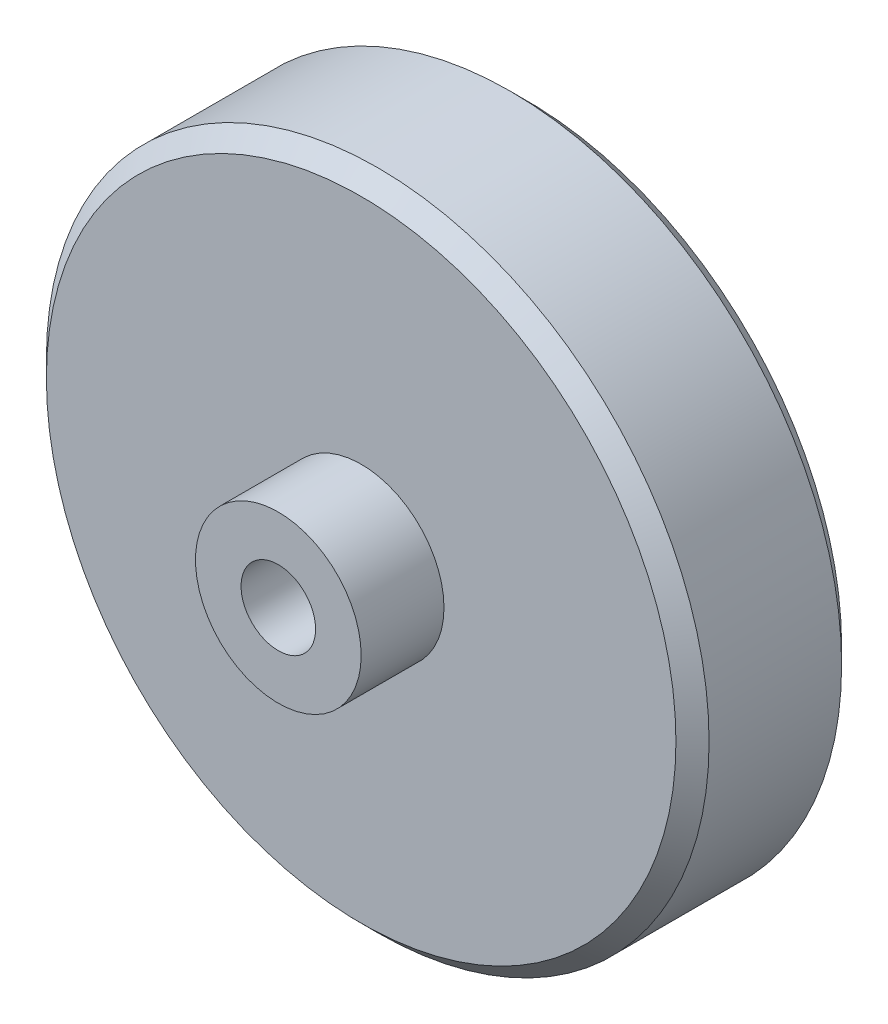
ISO-10303-21;
HEADER;
FILE_DESCRIPTION(('STEP AP214'),'2;1');
FILE_NAME('part.step','',(''),(''),'','','');
FILE_SCHEMA(('AUTOMOTIVE_DESIGN { 1 0 10303 214 1 1 1 1 }'));
ENDSEC;
DATA;
#1=APPLICATION_CONTEXT('core data for automotive mechanical design processes');
#2=APPLICATION_PROTOCOL_DEFINITION('international standard','automotive_design',2000,#1);
#3=PRODUCT_CONTEXT('',#1,'mechanical');
#4=PRODUCT('Part','Part','',(#3));
#5=PRODUCT_RELATED_PRODUCT_CATEGORY('part','',(#4));
#6=PRODUCT_DEFINITION_FORMATION('','',#4);
#7=PRODUCT_DEFINITION_CONTEXT('part definition',#1,'design');
#8=PRODUCT_DEFINITION('design','',#6,#7);
#9=PRODUCT_DEFINITION_SHAPE('','',#8);
#10=(LENGTH_UNIT() NAMED_UNIT(*) SI_UNIT(.MILLI.,.METRE.));
#11=(NAMED_UNIT(*) PLANE_ANGLE_UNIT() SI_UNIT($,.RADIAN.));
#12=(NAMED_UNIT(*) SI_UNIT($,.STERADIAN.) SOLID_ANGLE_UNIT());
#13=UNCERTAINTY_MEASURE_WITH_UNIT(LENGTH_MEASURE(1.E-05),#10,'distance_accuracy_value','');
#14=(GEOMETRIC_REPRESENTATION_CONTEXT(3) GLOBAL_UNCERTAINTY_ASSIGNED_CONTEXT((#13)) GLOBAL_UNIT_ASSIGNED_CONTEXT((#10,
#11,#12)) REPRESENTATION_CONTEXT('',''));
#15=CARTESIAN_POINT('',(0.,0.,0.));
#16=DIRECTION('',(0.,0.,1.));
#17=DIRECTION('',(1.,0.,0.));
#18=AXIS2_PLACEMENT_3D('',#15,#16,#17);
#19=CARTESIAN_POINT('',(0.,0.,10.));
#20=DIRECTION('',(0.,0.,1.));
#21=DIRECTION('',(1.,0.,0.));
#22=AXIS2_PLACEMENT_3D('',#19,#20,#21);
#23=PLANE('',#22);
#24=CARTESIAN_POINT('',(0.,0.,10.));
#25=DIRECTION('',(0.,0.,1.));
#26=DIRECTION('',(1.,0.,0.));
#27=AXIS2_PLACEMENT_3D('',#24,#25,#26);
#28=CIRCLE('',#27,19.);
#29=CARTESIAN_POINT('',(19.,0.,10.));
#30=VERTEX_POINT('',#29);
#31=EDGE_CURVE('E10',#30,#30,#28,.T.);
#32=ORIENTED_EDGE('',*,*,#31,.T.);
#33=EDGE_LOOP('',(#32));
#34=FACE_BOUND('',#33,.T.);
#35=CARTESIAN_POINT('',(0.,0.,10.));
#36=DIRECTION('',(0.,0.,1.));
#37=DIRECTION('',(1.,0.,0.));
#38=AXIS2_PLACEMENT_3D('',#35,#36,#37);
#39=CIRCLE('',#38,5.);
#40=CARTESIAN_POINT('',(5.,0.,10.));
#41=VERTEX_POINT('',#40);
#42=EDGE_CURVE('E50',#41,#41,#39,.T.);
#43=ORIENTED_EDGE('',*,*,#42,.F.);
#44=EDGE_LOOP('',(#43));
#45=FACE_BOUND('',#44,.T.);
#46=ADVANCED_FACE('F29',(#34,#45),#23,.T.);
#47=CARTESIAN_POINT('',(0.,0.,10.));
#48=DIRECTION('',(0.,0.,-1.));
#49=DIRECTION('',(-1.,0.,0.));
#50=AXIS2_PLACEMENT_3D('',#47,#48,#49);
#51=CYLINDRICAL_SURFACE('',#50,20.);
#52=CARTESIAN_POINT('',(0.,0.,1.));
#53=DIRECTION('',(0.,0.,1.));
#54=DIRECTION('',(1.,0.,0.));
#55=AXIS2_PLACEMENT_3D('',#52,#53,#54);
#56=CIRCLE('',#55,20.);
#57=CARTESIAN_POINT('',(20.,0.,1.));
#58=VERTEX_POINT('',#57);
#59=EDGE_CURVE('E40',#58,#58,#56,.T.);
#60=ORIENTED_EDGE('',*,*,#59,.T.);
#61=EDGE_LOOP('',(#60));
#62=FACE_BOUND('',#61,.T.);
#63=CARTESIAN_POINT('',(0.,0.,8.99999999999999));
#64=DIRECTION('',(0.,0.,1.));
#65=DIRECTION('',(1.,0.,0.));
#66=AXIS2_PLACEMENT_3D('',#63,#64,#65);
#67=CIRCLE('',#66,20.);
#68=CARTESIAN_POINT('',(20.,0.,8.99999999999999));
#69=VERTEX_POINT('',#68);
#70=EDGE_CURVE('E44',#69,#69,#67,.F.);
#71=ORIENTED_EDGE('',*,*,#70,.T.);
#72=EDGE_LOOP('',(#71));
#73=FACE_BOUND('',#72,.T.);
#74=ADVANCED_FACE('F84',(#62,#73),#51,.T.);
#75=CARTESIAN_POINT('',(0.,0.,0.));
#76=DIRECTION('',(0.,0.,1.));
#77=DIRECTION('',(1.,0.,0.));
#78=AXIS2_PLACEMENT_3D('',#75,#76,#77);
#79=PLANE('',#78);
#80=CARTESIAN_POINT('',(0.,0.,0.));
#81=DIRECTION('',(0.,0.,1.));
#82=DIRECTION('',(1.,0.,0.));
#83=AXIS2_PLACEMENT_3D('',#80,#81,#82);
#84=CIRCLE('',#83,19.);
#85=CARTESIAN_POINT('',(19.,0.,0.));
#86=VERTEX_POINT('',#85);
#87=EDGE_CURVE('E36',#86,#86,#84,.F.);
#88=ORIENTED_EDGE('',*,*,#87,.T.);
#89=EDGE_LOOP('',(#88));
#90=FACE_BOUND('',#89,.T.);
#91=CARTESIAN_POINT('',(0.,0.,0.));
#92=DIRECTION('',(0.,0.,1.));
#93=DIRECTION('',(1.,0.,0.));
#94=AXIS2_PLACEMENT_3D('',#91,#92,#93);
#95=CIRCLE('',#94,2.25);
#96=CARTESIAN_POINT('',(2.25,0.,0.));
#97=VERTEX_POINT('',#96);
#98=EDGE_CURVE('E53',#97,#97,#95,.T.);
#99=ORIENTED_EDGE('',*,*,#98,.T.);
#100=EDGE_LOOP('',(#99));
#101=FACE_BOUND('',#100,.T.);
#102=ADVANCED_FACE('F62',(#90,#101),#79,.F.);
#103=CARTESIAN_POINT('',(0.,0.,15.));
#104=DIRECTION('',(0.,0.,-1.));
#105=DIRECTION('',(-1.,0.,0.));
#106=AXIS2_PLACEMENT_3D('',#103,#104,#105);
#107=CYLINDRICAL_SURFACE('',#106,5.);
#108=CARTESIAN_POINT('',(0.,0.,15.));
#109=DIRECTION('',(0.,0.,1.));
#110=DIRECTION('',(1.,0.,0.));
#111=AXIS2_PLACEMENT_3D('',#108,#109,#110);
#112=CIRCLE('',#111,5.);
#113=CARTESIAN_POINT('',(5.,0.,15.));
#114=VERTEX_POINT('',#113);
#115=EDGE_CURVE('E49',#114,#114,#112,.T.);
#116=ORIENTED_EDGE('',*,*,#115,.F.);
#117=EDGE_LOOP('',(#116));
#118=FACE_BOUND('',#117,.T.);
#119=ORIENTED_EDGE('',*,*,#42,.T.);
#120=EDGE_LOOP('',(#119));
#121=FACE_BOUND('',#120,.T.);
#122=ADVANCED_FACE('F74',(#118,#121),#107,.T.);
#123=CARTESIAN_POINT('',(0.,0.,15.));
#124=DIRECTION('',(0.,0.,1.));
#125=DIRECTION('',(1.,0.,0.));
#126=AXIS2_PLACEMENT_3D('',#123,#124,#125);
#127=PLANE('',#126);
#128=CARTESIAN_POINT('',(0.,0.,15.));
#129=DIRECTION('',(0.,0.,1.));
#130=DIRECTION('',(1.,0.,0.));
#131=AXIS2_PLACEMENT_3D('',#128,#129,#130);
#132=CIRCLE('',#131,2.25);
#133=CARTESIAN_POINT('',(2.25,0.,15.));
#134=VERTEX_POINT('',#133);
#135=EDGE_CURVE('E56',#134,#134,#132,.T.);
#136=ORIENTED_EDGE('',*,*,#135,.F.);
#137=EDGE_LOOP('',(#136));
#138=FACE_BOUND('',#137,.T.);
#139=ORIENTED_EDGE('',*,*,#115,.T.);
#140=EDGE_LOOP('',(#139));
#141=FACE_BOUND('',#140,.T.);
#142=ADVANCED_FACE('F68',(#138,#141),#127,.T.);
#143=CARTESIAN_POINT('',(0.,0.,0.));
#144=DIRECTION('',(0.,0.,1.));
#145=DIRECTION('',(1.,0.,0.));
#146=AXIS2_PLACEMENT_3D('',#143,#144,#145);
#147=CYLINDRICAL_SURFACE('',#146,2.25);
#148=ORIENTED_EDGE('',*,*,#98,.F.);
#149=EDGE_LOOP('',(#148));
#150=FACE_BOUND('',#149,.T.);
#151=ORIENTED_EDGE('',*,*,#135,.T.);
#152=EDGE_LOOP('',(#151));
#153=FACE_BOUND('',#152,.T.);
#154=ADVANCED_FACE('F64',(#150,#153),#147,.F.);
#155=CARTESIAN_POINT('',(0.,0.,1.));
#156=DIRECTION('',(0.,0.,1.));
#157=DIRECTION('',(1.,0.,0.));
#158=AXIS2_PLACEMENT_3D('',#155,#156,#157);
#159=CONICAL_SURFACE('',#158,20.,0.785398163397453);
#160=ORIENTED_EDGE('',*,*,#87,.F.);
#161=EDGE_LOOP('',(#160));
#162=FACE_BOUND('',#161,.T.);
#163=ORIENTED_EDGE('',*,*,#59,.F.);
#164=EDGE_LOOP('',(#163));
#165=FACE_BOUND('',#164,.T.);
#166=ADVANCED_FACE('F67',(#162,#165),#159,.T.);
#167=CARTESIAN_POINT('',(0.,0.,10.));
#168=DIRECTION('',(0.,0.,-1.));
#169=DIRECTION('',(-1.,0.,0.));
#170=AXIS2_PLACEMENT_3D('',#167,#168,#169);
#171=CONICAL_SURFACE('',#170,19.,0.785398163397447);
#172=ORIENTED_EDGE('',*,*,#70,.F.);
#173=EDGE_LOOP('',(#172));
#174=FACE_BOUND('',#173,.T.);
#175=ORIENTED_EDGE('',*,*,#31,.F.);
#176=EDGE_LOOP('',(#175));
#177=FACE_BOUND('',#176,.T.);
#178=ADVANCED_FACE('F31',(#174,#177),#171,.T.);
#179=CLOSED_SHELL('',(#46,#74,#102,#122,#142,#154,#166,#178));
#180=MANIFOLD_SOLID_BREP('B2',#179);
#181=ADVANCED_BREP_SHAPE_REPRESENTATION('',(#18,#180),#14);
#182=SHAPE_DEFINITION_REPRESENTATION(#9,#181);
ENDSEC;
END-ISO-10303-21;
